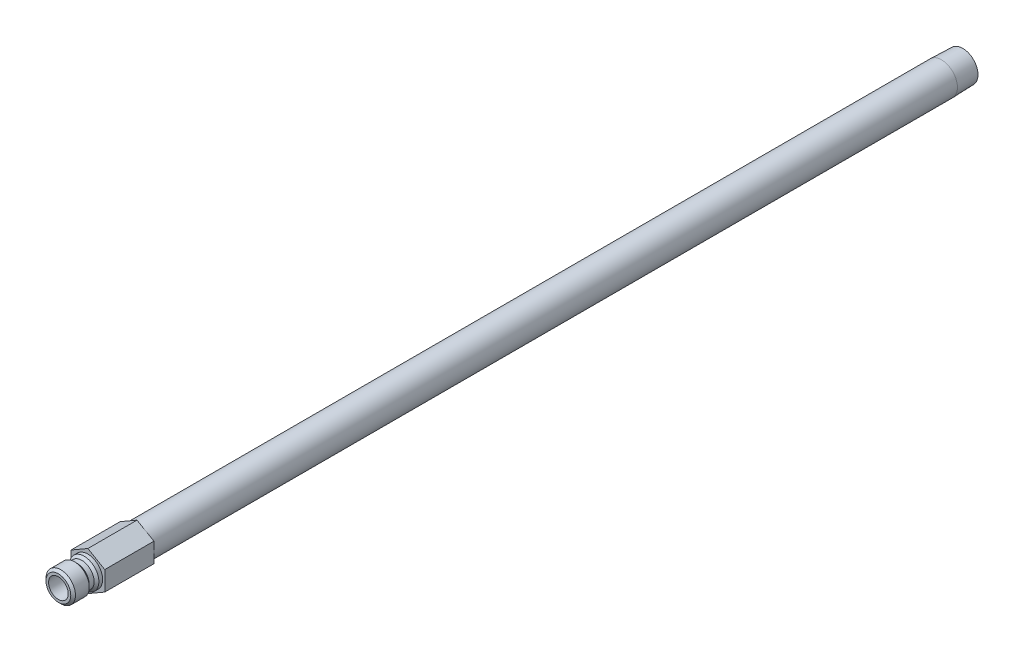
ISO-10303-21;
HEADER;
FILE_DESCRIPTION(('STEP AP214'),'2;1');
FILE_NAME('part.step','',(''),(''),'','','');
FILE_SCHEMA(('AUTOMOTIVE_DESIGN { 1 0 10303 214 1 1 1 1 }'));
ENDSEC;
DATA;
#1=APPLICATION_CONTEXT('core data for automotive mechanical design processes');
#2=APPLICATION_PROTOCOL_DEFINITION('international standard','automotive_design',2000,#1);
#3=PRODUCT_CONTEXT('',#1,'mechanical');
#4=PRODUCT('Part','Part','',(#3));
#5=PRODUCT_RELATED_PRODUCT_CATEGORY('part','',(#4));
#6=PRODUCT_DEFINITION_FORMATION('','',#4);
#7=PRODUCT_DEFINITION_CONTEXT('part definition',#1,'design');
#8=PRODUCT_DEFINITION('design','',#6,#7);
#9=PRODUCT_DEFINITION_SHAPE('','',#8);
#10=(LENGTH_UNIT() NAMED_UNIT(*) SI_UNIT(.MILLI.,.METRE.));
#11=(NAMED_UNIT(*) PLANE_ANGLE_UNIT() SI_UNIT($,.RADIAN.));
#12=(NAMED_UNIT(*) SI_UNIT($,.STERADIAN.) SOLID_ANGLE_UNIT());
#13=UNCERTAINTY_MEASURE_WITH_UNIT(LENGTH_MEASURE(1.E-05),#10,'distance_accuracy_value','');
#14=(GEOMETRIC_REPRESENTATION_CONTEXT(3) GLOBAL_UNCERTAINTY_ASSIGNED_CONTEXT((#13)) GLOBAL_UNIT_ASSIGNED_CONTEXT((#10,
#11,#12)) REPRESENTATION_CONTEXT('',''));
#15=CARTESIAN_POINT('',(0.,0.,0.));
#16=DIRECTION('',(0.,0.,1.));
#17=DIRECTION('',(1.,0.,0.));
#18=AXIS2_PLACEMENT_3D('',#15,#16,#17);
#19=CARTESIAN_POINT('',(0.,4.7625,0.));
#20=DIRECTION('',(0.,0.,1.));
#21=DIRECTION('',(0.,-1.,0.));
#22=AXIS2_PLACEMENT_3D('',#19,#20,#21);
#23=PLANE('',#22);
#24=CARTESIAN_POINT('',(0.,0.,0.));
#25=DIRECTION('',(0.,0.,-1.));
#26=DIRECTION('',(0.,1.,0.));
#27=AXIS2_PLACEMENT_3D('',#24,#25,#26);
#28=CIRCLE('',#27,4.7625);
#29=CARTESIAN_POINT('',(0.,4.7625,0.));
#30=VERTEX_POINT('',#29);
#31=EDGE_CURVE('E166',#30,#30,#28,.T.);
#32=ORIENTED_EDGE('',*,*,#31,.T.);
#33=EDGE_LOOP('',(#32));
#34=FACE_BOUND('',#33,.T.);
#35=DIRECTION('',(-0.866025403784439,-0.5,0.));
#36=VECTOR('',#35,1.);
#37=CARTESIAN_POINT('',(0.,6.3058196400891,0.));
#38=LINE('',#37,#36);
#39=CARTESIAN_POINT('',(0.,6.3058196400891,0.));
#40=VERTEX_POINT('',#39);
#41=CARTESIAN_POINT('',(-5.461,3.15290982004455,0.));
#42=VERTEX_POINT('',#41);
#43=EDGE_CURVE('E122',#40,#42,#38,.T.);
#44=ORIENTED_EDGE('',*,*,#43,.T.);
#45=DIRECTION('',(0.,-1.,0.));
#46=VECTOR('',#45,1.);
#47=CARTESIAN_POINT('',(-5.461,3.15290982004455,0.));
#48=LINE('',#47,#46);
#49=CARTESIAN_POINT('',(-5.461,-3.15290982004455,0.));
#50=VERTEX_POINT('',#49);
#51=EDGE_CURVE('E125',#42,#50,#48,.T.);
#52=ORIENTED_EDGE('',*,*,#51,.T.);
#53=DIRECTION('',(0.866025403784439,-0.5,0.));
#54=VECTOR('',#53,1.);
#55=CARTESIAN_POINT('',(-5.461,-3.15290982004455,0.));
#56=LINE('',#55,#54);
#57=CARTESIAN_POINT('',(0.,-6.30581964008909,0.));
#58=VERTEX_POINT('',#57);
#59=EDGE_CURVE('E129',#50,#58,#56,.T.);
#60=ORIENTED_EDGE('',*,*,#59,.T.);
#61=DIRECTION('',(0.866025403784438,0.5,0.));
#62=VECTOR('',#61,1.);
#63=CARTESIAN_POINT('',(0.,-6.30581964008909,0.));
#64=LINE('',#63,#62);
#65=CARTESIAN_POINT('',(5.461,-3.15290982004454,0.));
#66=VERTEX_POINT('',#65);
#67=EDGE_CURVE('E132',#58,#66,#64,.T.);
#68=ORIENTED_EDGE('',*,*,#67,.T.);
#69=DIRECTION('',(0.,1.,0.));
#70=VECTOR('',#69,1.);
#71=CARTESIAN_POINT('',(5.461,-3.15290982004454,0.));
#72=LINE('',#71,#70);
#73=CARTESIAN_POINT('',(5.461,3.15290982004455,0.));
#74=VERTEX_POINT('',#73);
#75=EDGE_CURVE('E99',#66,#74,#72,.T.);
#76=ORIENTED_EDGE('',*,*,#75,.T.);
#77=DIRECTION('',(-0.866025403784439,0.5,0.));
#78=VECTOR('',#77,1.);
#79=CARTESIAN_POINT('',(5.461,3.15290982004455,0.));
#80=LINE('',#79,#78);
#81=EDGE_CURVE('E135',#74,#40,#80,.T.);
#82=ORIENTED_EDGE('',*,*,#81,.T.);
#83=EDGE_LOOP('',(#44,#52,#60,#68,#76,#82));
#84=FACE_BOUND('',#83,.T.);
#85=ADVANCED_FACE('F33',(#34,#84),#23,.T.);
#86=CARTESIAN_POINT('',(0.,0.,0.));
#87=DIRECTION('',(0.,0.,-1.));
#88=DIRECTION('',(0.,1.,0.));
#89=AXIS2_PLACEMENT_3D('',#86,#87,#88);
#90=CYLINDRICAL_SURFACE('',#89,4.7625);
#91=CARTESIAN_POINT('',(0.,0.,1.2065));
#92=DIRECTION('',(0.,0.,-1.));
#93=DIRECTION('',(0.,1.,0.));
#94=AXIS2_PLACEMENT_3D('',#91,#92,#93);
#95=CIRCLE('',#94,4.7625);
#96=CARTESIAN_POINT('',(0.,4.7625,1.2065));
#97=VERTEX_POINT('',#96);
#98=EDGE_CURVE('E163',#97,#97,#95,.T.);
#99=ORIENTED_EDGE('',*,*,#98,.T.);
#100=EDGE_LOOP('',(#99));
#101=FACE_BOUND('',#100,.T.);
#102=ORIENTED_EDGE('',*,*,#31,.F.);
#103=EDGE_LOOP('',(#102));
#104=FACE_BOUND('',#103,.T.);
#105=ADVANCED_FACE('F192',(#101,#104),#90,.T.);
#106=CARTESIAN_POINT('',(0.,0.,1.2065));
#107=DIRECTION('',(0.,0.,-1.));
#108=DIRECTION('',(0.,1.,0.));
#109=AXIS2_PLACEMENT_3D('',#106,#107,#108);
#110=CONICAL_SURFACE('',#109,4.7625,0.785398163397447);
#111=CARTESIAN_POINT('',(0.,0.,1.9685));
#112=DIRECTION('',(0.,0.,-1.));
#113=DIRECTION('',(0.,1.,0.));
#114=AXIS2_PLACEMENT_3D('',#111,#112,#113);
#115=CIRCLE('',#114,4.0005);
#116=CARTESIAN_POINT('',(0.,4.0005,1.9685));
#117=VERTEX_POINT('',#116);
#118=EDGE_CURVE('E160',#117,#117,#115,.T.);
#119=ORIENTED_EDGE('',*,*,#118,.T.);
#120=EDGE_LOOP('',(#119));
#121=FACE_BOUND('',#120,.T.);
#122=ORIENTED_EDGE('',*,*,#98,.F.);
#123=EDGE_LOOP('',(#122));
#124=FACE_BOUND('',#123,.T.);
#125=ADVANCED_FACE('F198',(#121,#124),#110,.T.);
#126=CARTESIAN_POINT('',(0.,0.,0.));
#127=DIRECTION('',(0.,0.,-1.));
#128=DIRECTION('',(0.,1.,0.));
#129=AXIS2_PLACEMENT_3D('',#126,#127,#128);
#130=CYLINDRICAL_SURFACE('',#129,4.0005);
#131=CARTESIAN_POINT('',(0.,0.,3.556));
#132=DIRECTION('',(0.,0.,-1.));
#133=DIRECTION('',(0.,1.,0.));
#134=AXIS2_PLACEMENT_3D('',#131,#132,#133);
#135=CIRCLE('',#134,4.0005);
#136=CARTESIAN_POINT('',(0.,4.0005,3.556));
#137=VERTEX_POINT('',#136);
#138=EDGE_CURVE('E157',#137,#137,#135,.T.);
#139=ORIENTED_EDGE('',*,*,#138,.T.);
#140=EDGE_LOOP('',(#139));
#141=FACE_BOUND('',#140,.T.);
#142=ORIENTED_EDGE('',*,*,#118,.F.);
#143=EDGE_LOOP('',(#142));
#144=FACE_BOUND('',#143,.T.);
#145=ADVANCED_FACE('F258',(#141,#144),#130,.T.);
#146=CARTESIAN_POINT('',(0.,0.,3.556));
#147=DIRECTION('',(0.,0.,1.));
#148=DIRECTION('',(0.,-1.,0.));
#149=AXIS2_PLACEMENT_3D('',#146,#147,#148);
#150=CONICAL_SURFACE('',#149,4.0005,0.785398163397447);
#151=CARTESIAN_POINT('',(0.,0.,4.318));
#152=DIRECTION('',(0.,0.,-1.));
#153=DIRECTION('',(0.,1.,0.));
#154=AXIS2_PLACEMENT_3D('',#151,#152,#153);
#155=CIRCLE('',#154,4.7625);
#156=CARTESIAN_POINT('',(0.,4.7625,4.318));
#157=VERTEX_POINT('',#156);
#158=EDGE_CURVE('E154',#157,#157,#155,.T.);
#159=ORIENTED_EDGE('',*,*,#158,.T.);
#160=EDGE_LOOP('',(#159));
#161=FACE_BOUND('',#160,.T.);
#162=ORIENTED_EDGE('',*,*,#138,.F.);
#163=EDGE_LOOP('',(#162));
#164=FACE_BOUND('',#163,.T.);
#165=ADVANCED_FACE('F254',(#161,#164),#150,.T.);
#166=CARTESIAN_POINT('',(0.,0.,0.));
#167=DIRECTION('',(0.,0.,-1.));
#168=DIRECTION('',(0.,1.,0.));
#169=AXIS2_PLACEMENT_3D('',#166,#167,#168);
#170=CYLINDRICAL_SURFACE('',#169,4.7625);
#171=CARTESIAN_POINT('',(0.,0.,8.763));
#172=DIRECTION('',(0.,0.,-1.));
#173=DIRECTION('',(0.,1.,0.));
#174=AXIS2_PLACEMENT_3D('',#171,#172,#173);
#175=CIRCLE('',#174,4.7625);
#176=CARTESIAN_POINT('',(0.,4.7625,8.763));
#177=VERTEX_POINT('',#176);
#178=EDGE_CURVE('E151',#177,#177,#175,.T.);
#179=ORIENTED_EDGE('',*,*,#178,.T.);
#180=EDGE_LOOP('',(#179));
#181=FACE_BOUND('',#180,.T.);
#182=ORIENTED_EDGE('',*,*,#158,.F.);
#183=EDGE_LOOP('',(#182));
#184=FACE_BOUND('',#183,.T.);
#185=ADVANCED_FACE('F250',(#181,#184),#170,.T.);
#186=CARTESIAN_POINT('',(0.,0.,8.763));
#187=DIRECTION('',(0.,0.,-1.));
#188=DIRECTION('',(0.,1.,0.));
#189=AXIS2_PLACEMENT_3D('',#186,#187,#188);
#190=CONICAL_SURFACE('',#189,4.7625,0.785398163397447);
#191=CARTESIAN_POINT('',(0.,0.,9.525));
#192=DIRECTION('',(0.,0.,-1.));
#193=DIRECTION('',(0.,1.,0.));
#194=AXIS2_PLACEMENT_3D('',#191,#192,#193);
#195=CIRCLE('',#194,4.0005);
#196=CARTESIAN_POINT('',(0.,4.0005,9.525));
#197=VERTEX_POINT('',#196);
#198=EDGE_CURVE('E148',#197,#197,#195,.T.);
#199=ORIENTED_EDGE('',*,*,#198,.T.);
#200=EDGE_LOOP('',(#199));
#201=FACE_BOUND('',#200,.T.);
#202=ORIENTED_EDGE('',*,*,#178,.F.);
#203=EDGE_LOOP('',(#202));
#204=FACE_BOUND('',#203,.T.);
#205=ADVANCED_FACE('F246',(#201,#204),#190,.T.);
#206=CARTESIAN_POINT('',(0.,3.175,9.525));
#207=DIRECTION('',(0.,0.,1.));
#208=DIRECTION('',(0.,-1.,0.));
#209=AXIS2_PLACEMENT_3D('',#206,#207,#208);
#210=PLANE('',#209);
#211=CARTESIAN_POINT('',(0.,0.,9.525));
#212=DIRECTION('',(0.,0.,-1.));
#213=DIRECTION('',(0.,1.,0.));
#214=AXIS2_PLACEMENT_3D('',#211,#212,#213);
#215=CIRCLE('',#214,3.175);
#216=CARTESIAN_POINT('',(0.,3.175,9.525));
#217=VERTEX_POINT('',#216);
#218=EDGE_CURVE('E145',#217,#217,#215,.T.);
#219=ORIENTED_EDGE('',*,*,#218,.T.);
#220=EDGE_LOOP('',(#219));
#221=FACE_BOUND('',#220,.T.);
#222=ORIENTED_EDGE('',*,*,#198,.F.);
#223=EDGE_LOOP('',(#222));
#224=FACE_BOUND('',#223,.T.);
#225=ADVANCED_FACE('F242',(#221,#224),#210,.T.);
#226=CARTESIAN_POINT('',(0.,0.,0.));
#227=DIRECTION('',(0.,0.,-1.));
#228=DIRECTION('',(0.,1.,0.));
#229=AXIS2_PLACEMENT_3D('',#226,#227,#228);
#230=CYLINDRICAL_SURFACE('',#229,3.175);
#231=CARTESIAN_POINT('',(0.,0.,0.));
#232=DIRECTION('',(0.,0.,1.));
#233=DIRECTION('',(1.,0.,0.));
#234=AXIS2_PLACEMENT_3D('',#231,#232,#233);
#235=CIRCLE('',#234,3.175);
#236=CARTESIAN_POINT('',(3.175,0.,0.));
#237=VERTEX_POINT('',#236);
#238=EDGE_CURVE('E11',#237,#237,#235,.T.);
#239=ORIENTED_EDGE('',*,*,#238,.F.);
#240=EDGE_LOOP('',(#239));
#241=FACE_BOUND('',#240,.T.);
#242=ORIENTED_EDGE('',*,*,#218,.F.);
#243=EDGE_LOOP('',(#242));
#244=FACE_BOUND('',#243,.T.);
#245=ADVANCED_FACE('F226',(#241,#244),#230,.F.);
#246=CARTESIAN_POINT('',(-5.461,3.15290982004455,0.));
#247=DIRECTION('',(0.,0.,1.));
#248=DIRECTION('',(1.,0.,0.));
#249=AXIS2_PLACEMENT_3D('',#246,#247,#248);
#250=PLANE('',#249);
#251=ORIENTED_EDGE('',*,*,#238,.T.);
#252=EDGE_LOOP('',(#251));
#253=FACE_BOUND('',#252,.T.);
#254=CARTESIAN_POINT('',(0.,0.,0.));
#255=DIRECTION('',(0.,0.,1.));
#256=DIRECTION('',(1.,0.,0.));
#257=AXIS2_PLACEMENT_3D('',#254,#255,#256);
#258=CIRCLE('',#257,2.38124999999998);
#259=CARTESIAN_POINT('',(2.38124999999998,0.,0.));
#260=VERTEX_POINT('',#259);
#261=EDGE_CURVE('E126',#260,#260,#258,.T.);
#262=ORIENTED_EDGE('',*,*,#261,.F.);
#263=EDGE_LOOP('',(#262));
#264=FACE_BOUND('',#263,.T.);
#265=ADVANCED_FACE('F222',(#253,#264),#250,.T.);
#266=CARTESIAN_POINT('',(0.,6.3058196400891,-15.875));
#267=DIRECTION('',(-0.5,0.866025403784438,0.));
#268=DIRECTION('',(-0.866025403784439,-0.5,0.));
#269=AXIS2_PLACEMENT_3D('',#266,#267,#268);
#270=PLANE('',#269);
#271=ORIENTED_EDGE('',*,*,#43,.F.);
#272=DIRECTION('',(0.,0.,1.));
#273=VECTOR('',#272,1.);
#274=CARTESIAN_POINT('',(0.,6.3058196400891,-15.875));
#275=LINE('',#274,#273);
#276=CARTESIAN_POINT('',(0.,6.3058196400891,-15.875));
#277=VERTEX_POINT('',#276);
#278=EDGE_CURVE('E51',#277,#40,#275,.T.);
#279=ORIENTED_EDGE('',*,*,#278,.F.);
#280=DIRECTION('',(-0.866025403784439,-0.5,0.));
#281=VECTOR('',#280,1.);
#282=CARTESIAN_POINT('',(0.,6.3058196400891,-15.875));
#283=LINE('',#282,#281);
#284=CARTESIAN_POINT('',(-5.461,3.15290982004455,-15.875));
#285=VERTEX_POINT('',#284);
#286=EDGE_CURVE('E138',#277,#285,#283,.T.);
#287=ORIENTED_EDGE('',*,*,#286,.T.);
#288=DIRECTION('',(0.,0.,1.));
#289=VECTOR('',#288,1.);
#290=CARTESIAN_POINT('',(-5.461,3.15290982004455,-15.875));
#291=LINE('',#290,#289);
#292=EDGE_CURVE('E86',#285,#42,#291,.T.);
#293=ORIENTED_EDGE('',*,*,#292,.T.);
#294=EDGE_LOOP('',(#271,#279,#287,#293));
#295=FACE_BOUND('',#294,.T.);
#296=ADVANCED_FACE('F225',(#295),#270,.T.);
#297=CARTESIAN_POINT('',(5.461,3.15290982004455,-15.875));
#298=DIRECTION('',(0.5,0.866025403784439,0.));
#299=DIRECTION('',(-0.866025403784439,0.5,0.));
#300=AXIS2_PLACEMENT_3D('',#297,#298,#299);
#301=PLANE('',#300);
#302=ORIENTED_EDGE('',*,*,#81,.F.);
#303=DIRECTION('',(0.,0.,1.));
#304=VECTOR('',#303,1.);
#305=CARTESIAN_POINT('',(5.461,3.15290982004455,-15.875));
#306=LINE('',#305,#304);
#307=CARTESIAN_POINT('',(5.461,3.15290982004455,-15.875));
#308=VERTEX_POINT('',#307);
#309=EDGE_CURVE('E74',#308,#74,#306,.T.);
#310=ORIENTED_EDGE('',*,*,#309,.F.);
#311=DIRECTION('',(-0.866025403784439,0.5,0.));
#312=VECTOR('',#311,1.);
#313=CARTESIAN_POINT('',(5.461,3.15290982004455,-15.875));
#314=LINE('',#313,#312);
#315=EDGE_CURVE('E112',#308,#277,#314,.T.);
#316=ORIENTED_EDGE('',*,*,#315,.T.);
#317=ORIENTED_EDGE('',*,*,#278,.T.);
#318=EDGE_LOOP('',(#302,#310,#316,#317));
#319=FACE_BOUND('',#318,.T.);
#320=ADVANCED_FACE('F228',(#319),#301,.T.);
#321=CARTESIAN_POINT('',(5.461,-3.15290982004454,-15.875));
#322=DIRECTION('',(1.,0.,0.));
#323=DIRECTION('',(0.,1.,0.));
#324=AXIS2_PLACEMENT_3D('',#321,#322,#323);
#325=PLANE('',#324);
#326=ORIENTED_EDGE('',*,*,#75,.F.);
#327=DIRECTION('',(0.,0.,1.));
#328=VECTOR('',#327,1.);
#329=CARTESIAN_POINT('',(5.461,-3.15290982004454,-15.875));
#330=LINE('',#329,#328);
#331=CARTESIAN_POINT('',(5.461,-3.15290982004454,-15.875));
#332=VERTEX_POINT('',#331);
#333=EDGE_CURVE('E94',#332,#66,#330,.T.);
#334=ORIENTED_EDGE('',*,*,#333,.F.);
#335=DIRECTION('',(0.,1.,0.));
#336=VECTOR('',#335,1.);
#337=CARTESIAN_POINT('',(5.461,-3.15290982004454,-15.875));
#338=LINE('',#337,#336);
#339=EDGE_CURVE('E97',#332,#308,#338,.T.);
#340=ORIENTED_EDGE('',*,*,#339,.T.);
#341=ORIENTED_EDGE('',*,*,#309,.T.);
#342=EDGE_LOOP('',(#326,#334,#340,#341));
#343=FACE_BOUND('',#342,.T.);
#344=ADVANCED_FACE('F96',(#343),#325,.T.);
#345=CARTESIAN_POINT('',(0.,-6.30581964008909,-15.875));
#346=DIRECTION('',(0.5,-0.866025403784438,0.));
#347=DIRECTION('',(0.866025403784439,0.5,0.));
#348=AXIS2_PLACEMENT_3D('',#345,#346,#347);
#349=PLANE('',#348);
#350=ORIENTED_EDGE('',*,*,#67,.F.);
#351=DIRECTION('',(0.,0.,1.));
#352=VECTOR('',#351,1.);
#353=CARTESIAN_POINT('',(0.,-6.30581964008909,-15.875));
#354=LINE('',#353,#352);
#355=CARTESIAN_POINT('',(0.,-6.30581964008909,-15.875));
#356=VERTEX_POINT('',#355);
#357=EDGE_CURVE('E104',#356,#58,#354,.T.);
#358=ORIENTED_EDGE('',*,*,#357,.F.);
#359=DIRECTION('',(0.866025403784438,0.5,0.));
#360=VECTOR('',#359,1.);
#361=CARTESIAN_POINT('',(0.,-6.30581964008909,-15.875));
#362=LINE('',#361,#360);
#363=EDGE_CURVE('E110',#356,#332,#362,.T.);
#364=ORIENTED_EDGE('',*,*,#363,.T.);
#365=ORIENTED_EDGE('',*,*,#333,.T.);
#366=EDGE_LOOP('',(#350,#358,#364,#365));
#367=FACE_BOUND('',#366,.T.);
#368=ADVANCED_FACE('F114',(#367),#349,.T.);
#369=CARTESIAN_POINT('',(-5.461,-3.15290982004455,-15.875));
#370=DIRECTION('',(-0.5,-0.866025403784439,0.));
#371=DIRECTION('',(0.866025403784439,-0.5,0.));
#372=AXIS2_PLACEMENT_3D('',#369,#370,#371);
#373=PLANE('',#372);
#374=ORIENTED_EDGE('',*,*,#59,.F.);
#375=DIRECTION('',(0.,0.,1.));
#376=VECTOR('',#375,1.);
#377=CARTESIAN_POINT('',(-5.461,-3.15290982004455,-15.875));
#378=LINE('',#377,#376);
#379=CARTESIAN_POINT('',(-5.461,-3.15290982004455,-15.875));
#380=VERTEX_POINT('',#379);
#381=EDGE_CURVE('E142',#380,#50,#378,.T.);
#382=ORIENTED_EDGE('',*,*,#381,.F.);
#383=DIRECTION('',(0.866025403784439,-0.5,0.));
#384=VECTOR('',#383,1.);
#385=CARTESIAN_POINT('',(-5.461,-3.15290982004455,-15.875));
#386=LINE('',#385,#384);
#387=EDGE_CURVE('E115',#380,#356,#386,.T.);
#388=ORIENTED_EDGE('',*,*,#387,.T.);
#389=ORIENTED_EDGE('',*,*,#357,.T.);
#390=EDGE_LOOP('',(#374,#382,#388,#389));
#391=FACE_BOUND('',#390,.T.);
#392=ADVANCED_FACE('F219',(#391),#373,.T.);
#393=CARTESIAN_POINT('',(-5.461,3.15290982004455,-15.875));
#394=DIRECTION('',(-1.,0.,0.));
#395=DIRECTION('',(0.,0.,1.));
#396=AXIS2_PLACEMENT_3D('',#393,#394,#395);
#397=PLANE('',#396);
#398=ORIENTED_EDGE('',*,*,#51,.F.);
#399=ORIENTED_EDGE('',*,*,#292,.F.);
#400=DIRECTION('',(0.,-1.,0.));
#401=VECTOR('',#400,1.);
#402=CARTESIAN_POINT('',(-5.461,3.15290982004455,-15.875));
#403=LINE('',#402,#401);
#404=EDGE_CURVE('E117',#285,#380,#403,.T.);
#405=ORIENTED_EDGE('',*,*,#404,.T.);
#406=ORIENTED_EDGE('',*,*,#381,.T.);
#407=EDGE_LOOP('',(#398,#399,#405,#406));
#408=FACE_BOUND('',#407,.T.);
#409=ADVANCED_FACE('F214',(#408),#397,.T.);
#410=CARTESIAN_POINT('',(-5.461,3.15290982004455,-15.875));
#411=DIRECTION('',(0.,0.,1.));
#412=DIRECTION('',(1.,0.,0.));
#413=AXIS2_PLACEMENT_3D('',#410,#411,#412);
#414=PLANE('',#413);
#415=CARTESIAN_POINT('',(0.,0.,-15.875));
#416=DIRECTION('',(0.,0.,1.));
#417=DIRECTION('',(1.,0.,0.));
#418=AXIS2_PLACEMENT_3D('',#415,#416,#417);
#419=CIRCLE('',#418,5.14349999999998);
#420=CARTESIAN_POINT('',(5.14349999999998,0.,-15.875));
#421=VERTEX_POINT('',#420);
#422=EDGE_CURVE('E37',#421,#421,#419,.F.);
#423=ORIENTED_EDGE('',*,*,#422,.F.);
#424=EDGE_LOOP('',(#423));
#425=FACE_BOUND('',#424,.T.);
#426=ORIENTED_EDGE('',*,*,#286,.F.);
#427=ORIENTED_EDGE('',*,*,#315,.F.);
#428=ORIENTED_EDGE('',*,*,#339,.F.);
#429=ORIENTED_EDGE('',*,*,#363,.F.);
#430=ORIENTED_EDGE('',*,*,#387,.F.);
#431=ORIENTED_EDGE('',*,*,#404,.F.);
#432=EDGE_LOOP('',(#426,#427,#428,#429,#430,#431));
#433=FACE_BOUND('',#432,.T.);
#434=ADVANCED_FACE('F108',(#425,#433),#414,.F.);
#435=CARTESIAN_POINT('',(0.,0.,0.));
#436=DIRECTION('',(0.,0.,-1.));
#437=DIRECTION('',(0.,1.,0.));
#438=AXIS2_PLACEMENT_3D('',#435,#436,#437);
#439=CYLINDRICAL_SURFACE('',#438,2.38124999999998);
#440=CARTESIAN_POINT('',(0.,0.,-282.575));
#441=DIRECTION('',(0.,0.,-1.));
#442=DIRECTION('',(0.,1.,0.));
#443=AXIS2_PLACEMENT_3D('',#440,#441,#442);
#444=CIRCLE('',#443,2.38124999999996);
#445=CARTESIAN_POINT('',(0.,2.38125,-282.575));
#446=VERTEX_POINT('',#445);
#447=EDGE_CURVE('E43',#446,#446,#444,.T.);
#448=ORIENTED_EDGE('',*,*,#447,.T.);
#449=EDGE_LOOP('',(#448));
#450=FACE_BOUND('',#449,.T.);
#451=ORIENTED_EDGE('',*,*,#261,.T.);
#452=EDGE_LOOP('',(#451));
#453=FACE_BOUND('',#452,.T.);
#454=ADVANCED_FACE('F35',(#450,#453),#439,.F.);
#455=CARTESIAN_POINT('',(0.,4.9291887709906,-282.575));
#456=DIRECTION('',(0.,0.,-1.));
#457=DIRECTION('',(0.,1.,0.));
#458=AXIS2_PLACEMENT_3D('',#455,#456,#457);
#459=PLANE('',#458);
#460=CARTESIAN_POINT('',(0.,0.,-282.575));
#461=DIRECTION('',(0.,0.,-1.));
#462=DIRECTION('',(0.,1.,0.));
#463=AXIS2_PLACEMENT_3D('',#460,#461,#462);
#464=CIRCLE('',#463,4.92918877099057);
#465=CARTESIAN_POINT('',(0.,4.9291887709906,-282.575));
#466=VERTEX_POINT('',#465);
#467=EDGE_CURVE('E172',#466,#466,#464,.T.);
#468=ORIENTED_EDGE('',*,*,#467,.T.);
#469=EDGE_LOOP('',(#468));
#470=FACE_BOUND('',#469,.T.);
#471=ORIENTED_EDGE('',*,*,#447,.F.);
#472=EDGE_LOOP('',(#471));
#473=FACE_BOUND('',#472,.T.);
#474=ADVANCED_FACE('F180',(#470,#473),#459,.T.);
#475=CARTESIAN_POINT('',(0.,0.,-282.575));
#476=DIRECTION('',(0.,0.,1.));
#477=DIRECTION('',(0.,-1.,0.));
#478=AXIS2_PLACEMENT_3D('',#475,#476,#477);
#479=CONICAL_SURFACE('',#478,4.92918877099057,0.0312396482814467);
#480=CARTESIAN_POINT('',(0.,0.,-275.717));
#481=DIRECTION('',(0.,0.,-1.));
#482=DIRECTION('',(0.,1.,0.));
#483=AXIS2_PLACEMENT_3D('',#480,#481,#482);
#484=CIRCLE('',#483,5.14349999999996);
#485=CARTESIAN_POINT('',(0.,5.1435,-275.717));
#486=VERTEX_POINT('',#485);
#487=EDGE_CURVE('E169',#486,#486,#484,.T.);
#488=ORIENTED_EDGE('',*,*,#487,.T.);
#489=EDGE_LOOP('',(#488));
#490=FACE_BOUND('',#489,.T.);
#491=ORIENTED_EDGE('',*,*,#467,.F.);
#492=EDGE_LOOP('',(#491));
#493=FACE_BOUND('',#492,.T.);
#494=ADVANCED_FACE('F182',(#490,#493),#479,.T.);
#495=CARTESIAN_POINT('',(0.,0.,0.));
#496=DIRECTION('',(0.,0.,-1.));
#497=DIRECTION('',(0.,1.,0.));
#498=AXIS2_PLACEMENT_3D('',#495,#496,#497);
#499=CYLINDRICAL_SURFACE('',#498,5.14349999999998);
#500=ORIENTED_EDGE('',*,*,#487,.F.);
#501=EDGE_LOOP('',(#500));
#502=FACE_BOUND('',#501,.T.);
#503=ORIENTED_EDGE('',*,*,#422,.T.);
#504=EDGE_LOOP('',(#503));
#505=FACE_BOUND('',#504,.T.);
#506=ADVANCED_FACE('F188',(#502,#505),#499,.T.);
#507=CLOSED_SHELL('',(#85,#105,#125,#145,#165,#185,#205,#225,#245,#265,#296,#320,#344,#368,#392,
#409,#434,#454,#474,#494,#506));
#508=MANIFOLD_SOLID_BREP('B2',#507);
#509=ADVANCED_BREP_SHAPE_REPRESENTATION('',(#18,#508),#14);
#510=SHAPE_DEFINITION_REPRESENTATION(#9,#509);
ENDSEC;
END-ISO-10303-21;
